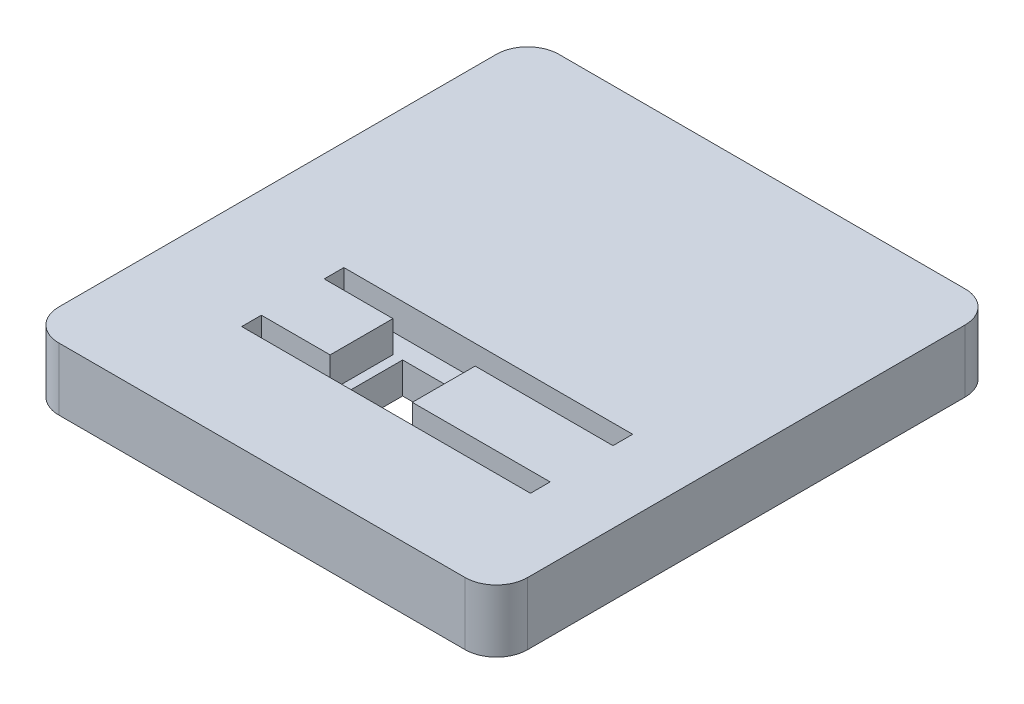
from build123d import *

# Parameters (mm, degrees)
ESQUISSE1_W             = 75
ESQUISSE1_H             = 80
BOSS_EXTRU_1_DEPTH      = 10
ESQUISSE2_W             = 10.15
ESQUISSE2_H             = 10.15
ENL_V_MAT_EXTRU_1_DEPTH = 15
CONG_1_R                = 5
ESQUISSE4_W             = 10.15
ESQUISSE4_H             = 10.15
ENL_V_MAT_EXTRU_2_DEPTH = 5


with BuildPart() as part:
    # Esquisse1 → Boss.-Extru.1 (new body)
    with BuildSketch(Plane(origin=(0, 0, 0), x_dir=(1, 0, 0), z_dir=(0, 1, 0))):
        with Locations((0, 10)):
            Rectangle(ESQUISSE1_W, ESQUISSE1_H)
    extrude(amount=BOSS_EXTRU_1_DEPTH)

    # Esquisse2 → Enl_v. mat.-Extru.1 (cut)
    with BuildSketch(Plane(origin=(0, 10, 0), x_dir=(1, 0, 0), z_dir=(0, 1, 0))):
        with Locations((-2.575, -4.925)):
            Rectangle(ESQUISSE2_W, ESQUISSE2_H)
    extrude(amount=-ENL_V_MAT_EXTRU_1_DEPTH, mode=Mode.SUBTRACT)

    # Cong_1
    cong_1_edges = [part.edges().sort_by_distance(p)[0] for p in [
        (37.5, 5, 30),
        (-37.5, 5, 30),
        (-37.5, 5, -50),
        (37.5, 5, -50),
    ]]
    fillet(cong_1_edges, radius=CONG_1_R)

    # Esquisse4 → Enl_v. mat.-Extru.2 (cut)
    with BuildSketch(Plane(origin=(0, 10, 0), x_dir=(1, 0, 0), z_dir=(0, 1, 0))):
        Polygon((-9.15, 3.2525), (26.053483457, 3.2525), (26.053483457, 0.1025), (4, 0.1025), (4, -9.9475), (26.053483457, -9.9475), (26.053483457, -13.0975), (-9.15, -13.0975), (-20.15, -13.0975), (-20.15, -9.9475), (-9.15, -9.9475), (-9.15, 0.1025), (-20.15, 0.1025), (-20.15, 3.2525), align=None)
        with Locations((-2.575, -4.925)):
            Rectangle(ESQUISSE4_W, ESQUISSE4_H, mode=Mode.SUBTRACT)
    extrude(amount=-ENL_V_MAT_EXTRU_2_DEPTH, mode=Mode.SUBTRACT)


solid = part.part
